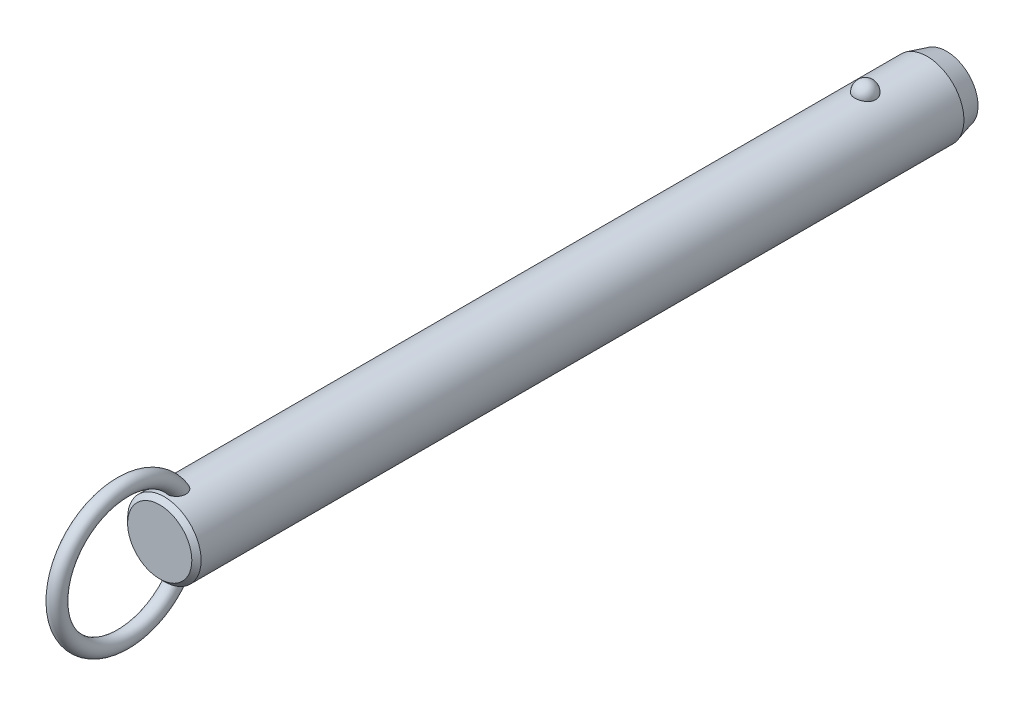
ISO-10303-21;
HEADER;
FILE_DESCRIPTION(('STEP AP214'),'2;1');
FILE_NAME('part.step','',(''),(''),'','','');
FILE_SCHEMA(('AUTOMOTIVE_DESIGN { 1 0 10303 214 1 1 1 1 }'));
ENDSEC;
DATA;
#1=APPLICATION_CONTEXT('core data for automotive mechanical design processes');
#2=APPLICATION_PROTOCOL_DEFINITION('international standard','automotive_design',2000,#1);
#3=PRODUCT_CONTEXT('',#1,'mechanical');
#4=PRODUCT('Part','Part','',(#3));
#5=PRODUCT_RELATED_PRODUCT_CATEGORY('part','',(#4));
#6=PRODUCT_DEFINITION_FORMATION('','',#4);
#7=PRODUCT_DEFINITION_CONTEXT('part definition',#1,'design');
#8=PRODUCT_DEFINITION('design','',#6,#7);
#9=PRODUCT_DEFINITION_SHAPE('','',#8);
#10=(LENGTH_UNIT() NAMED_UNIT(*) SI_UNIT(.MILLI.,.METRE.));
#11=(NAMED_UNIT(*) PLANE_ANGLE_UNIT() SI_UNIT($,.RADIAN.));
#12=(NAMED_UNIT(*) SI_UNIT($,.STERADIAN.) SOLID_ANGLE_UNIT());
#13=UNCERTAINTY_MEASURE_WITH_UNIT(LENGTH_MEASURE(1.E-05),#10,'distance_accuracy_value','');
#14=(GEOMETRIC_REPRESENTATION_CONTEXT(3) GLOBAL_UNCERTAINTY_ASSIGNED_CONTEXT((#13)) GLOBAL_UNIT_ASSIGNED_CONTEXT((#10,
#11,#12)) REPRESENTATION_CONTEXT('',''));
#15=CARTESIAN_POINT('',(0.,0.,0.));
#16=DIRECTION('',(0.,0.,1.));
#17=DIRECTION('',(1.,0.,0.));
#18=AXIS2_PLACEMENT_3D('',#15,#16,#17);
#19=CARTESIAN_POINT('',(0.,0.,170.2));
#20=DIRECTION('',(0.,0.,-1.));
#21=DIRECTION('',(-1.,0.,0.));
#22=AXIS2_PLACEMENT_3D('',#19,#20,#21);
#23=CYLINDRICAL_SURFACE('',#22,9.5);
#24=CARTESIAN_POINT('',(2.67259918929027,9.11631578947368,-2.70000000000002));
#25=CARTESIAN_POINT('',(2.6725968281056,9.11631786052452,-2.54909854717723));
#26=CARTESIAN_POINT('',(2.66030567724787,9.11994722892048,-2.39816735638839));
#27=CARTESIAN_POINT('',(2.6114347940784,9.13405924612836,-2.10058568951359));
#28=CARTESIAN_POINT('',(2.57484658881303,9.14454428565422,-1.95393672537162));
#29=CARTESIAN_POINT('',(2.47830875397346,9.17117631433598,-1.66916069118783));
#30=CARTESIAN_POINT('',(2.41836936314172,9.18732082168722,-1.53102991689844));
#31=CARTESIAN_POINT('',(2.27661331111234,9.22346780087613,-1.26705393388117));
#32=CARTESIAN_POINT('',(2.19479699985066,9.24347021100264,-1.14120852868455));
#33=CARTESIAN_POINT('',(2.01085282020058,9.28522401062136,-0.904632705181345));
#34=CARTESIAN_POINT('',(1.90862396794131,9.30698376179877,-0.793982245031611));
#35=CARTESIAN_POINT('',(1.6867437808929,9.34973971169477,-0.59160721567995));
#36=CARTESIAN_POINT('',(1.56709244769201,9.37073591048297,-0.499882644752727));
#37=CARTESIAN_POINT('',(1.31393976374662,9.40956370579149,-0.338167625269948));
#38=CARTESIAN_POINT('',(1.18048026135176,9.42740444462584,-0.268113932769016));
#39=CARTESIAN_POINT('',(0.903154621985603,9.45799906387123,-0.151390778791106));
#40=CARTESIAN_POINT('',(0.759289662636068,9.47075351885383,-0.104718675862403));
#41=CARTESIAN_POINT('',(0.468074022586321,9.48956256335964,-0.0367633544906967));
#42=CARTESIAN_POINT('',(0.320836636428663,9.49573643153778,-0.0150275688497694));
#43=CARTESIAN_POINT('',(0.0246714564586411,9.50112183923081,0.00396199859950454));
#44=CARTESIAN_POINT('',(-0.124256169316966,9.50033406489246,0.00121819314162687));
#45=CARTESIAN_POINT('',(-0.417264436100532,9.4919475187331,-0.0284441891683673));
#46=CARTESIAN_POINT('',(-0.56138413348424,9.48444885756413,-0.0550074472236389));
#47=CARTESIAN_POINT('',(-0.842986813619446,9.46357853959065,-0.131064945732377));
#48=CARTESIAN_POINT('',(-0.980469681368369,9.450206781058,-0.180559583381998));
#49=CARTESIAN_POINT('',(-1.24585005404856,9.41890822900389,-0.301476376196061));
#50=CARTESIAN_POINT('',(-1.37368611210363,9.40095498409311,-0.373026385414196));
#51=CARTESIAN_POINT('',(-1.61552738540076,9.36242964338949,-0.536025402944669));
#52=CARTESIAN_POINT('',(-1.72953116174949,9.34185727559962,-0.627476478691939));
#53=CARTESIAN_POINT('',(-1.9429225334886,9.29984568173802,-0.829844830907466));
#54=CARTESIAN_POINT('',(-2.04198021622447,9.27839736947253,-0.941108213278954));
#55=CARTESIAN_POINT('',(-2.22026460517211,9.23735994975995,-1.17883414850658));
#56=CARTESIAN_POINT('',(-2.29948985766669,9.21777097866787,-1.30529781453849));
#57=CARTESIAN_POINT('',(-2.43697287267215,9.18238994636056,-1.57158566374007));
#58=CARTESIAN_POINT('',(-2.49497068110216,9.16664569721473,-1.71155057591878));
#59=CARTESIAN_POINT('',(-2.5872073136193,9.14104303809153,-1.99961197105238));
#60=CARTESIAN_POINT('',(-2.62144683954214,9.13118445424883,-2.1477082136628));
#61=CARTESIAN_POINT('',(-2.66521466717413,9.11850622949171,-2.44715424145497));
#62=CARTESIAN_POINT('',(-2.67484831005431,9.11565658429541,-2.59848735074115));
#63=CARTESIAN_POINT('',(-2.66946735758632,9.11723375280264,-2.90067317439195));
#64=CARTESIAN_POINT('',(-2.65445345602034,9.12166036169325,-3.05152590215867));
#65=CARTESIAN_POINT('',(-2.60029711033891,9.13724422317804,-3.34766110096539));
#66=CARTESIAN_POINT('',(-2.56127978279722,9.14836656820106,-3.49296833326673));
#67=CARTESIAN_POINT('',(-2.46018844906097,9.17606676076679,-3.77477535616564));
#68=CARTESIAN_POINT('',(-2.39811349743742,9.1926448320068,-3.91127478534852));
#69=CARTESIAN_POINT('',(-2.25202303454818,9.22952198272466,-4.17244273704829));
#70=CARTESIAN_POINT('',(-2.16788714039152,9.24984129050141,-4.29704106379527));
#71=CARTESIAN_POINT('',(-1.9799408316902,9.29188255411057,-4.53013066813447));
#72=CARTESIAN_POINT('',(-1.87612963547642,9.31360456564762,-4.63862130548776));
#73=CARTESIAN_POINT('',(-1.65105429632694,9.35612959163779,-4.83690299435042));
#74=CARTESIAN_POINT('',(-1.52972405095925,9.37692871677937,-4.9266199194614));
#75=CARTESIAN_POINT('',(-1.27318250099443,9.41518970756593,-5.08429106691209));
#76=CARTESIAN_POINT('',(-1.13797219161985,9.432651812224,-5.15224684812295));
#77=CARTESIAN_POINT('',(-0.859280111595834,9.46208255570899,-5.26371827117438));
#78=CARTESIAN_POINT('',(-0.715925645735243,9.47411833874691,-5.30753421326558));
#79=CARTESIAN_POINT('',(-0.423550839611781,9.4916822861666,-5.37076321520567));
#80=CARTESIAN_POINT('',(-0.2745312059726,9.49721125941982,-5.39017930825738));
#81=CARTESIAN_POINT('',(0.0218446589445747,9.50110860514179,-5.40390587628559));
#82=CARTESIAN_POINT('',(0.16917707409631,9.49961381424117,-5.39869609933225));
#83=CARTESIAN_POINT('',(0.460808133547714,9.48993906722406,-5.36441955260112));
#84=CARTESIAN_POINT('',(0.605106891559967,9.48175936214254,-5.33535367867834));
#85=CARTESIAN_POINT('',(0.886027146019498,9.4596376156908,-5.25435587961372));
#86=CARTESIAN_POINT('',(1.02267710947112,9.44571881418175,-5.20251612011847));
#87=CARTESIAN_POINT('',(1.28523827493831,9.41358993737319,-5.07741549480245));
#88=CARTESIAN_POINT('',(1.41114877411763,9.39537958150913,-5.00415322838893));
#89=CARTESIAN_POINT('',(1.65085227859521,9.3562644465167,-4.83684599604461));
#90=CARTESIAN_POINT('',(1.76442346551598,9.33532178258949,-4.74249218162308));
#91=CARTESIAN_POINT('',(1.97425672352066,9.29321198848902,-4.53620389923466));
#92=CARTESIAN_POINT('',(2.07051582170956,9.27204482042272,-4.42426641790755));
#93=CARTESIAN_POINT('',(2.24490086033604,9.23139221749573,-4.18363183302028));
#94=CARTESIAN_POINT('',(2.32267019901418,9.21194380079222,-4.05466990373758));
#95=CARTESIAN_POINT('',(2.45584092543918,9.1773419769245,-3.78517836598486));
#96=CARTESIAN_POINT('',(2.5112497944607,9.16218713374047,-3.644652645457));
#97=CARTESIAN_POINT('',(2.59380876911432,9.13913522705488,-3.37104301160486));
#98=CARTESIAN_POINT('',(2.62330266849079,9.13064624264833,-3.23871053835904));
#99=CARTESIAN_POINT('',(2.66269870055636,9.11923566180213,-2.97092664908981));
#100=CARTESIAN_POINT('',(2.67260130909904,9.11631393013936,-2.83547530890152));
#101=CARTESIAN_POINT('',(2.67259918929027,9.11631578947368,-2.70000000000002));
#102=B_SPLINE_CURVE_WITH_KNOTS('',3,(#24,#25,#26,#27,#28,#29,#30,#31,#32,#33,#34,#35,#36,#37,
#38,#39,#40,#41,#42,#43,#44,#45,#46,#47,#48,#49,#50,#51,#52,#53,#54,#55,#56,#57,#58,#59,#60,#61,
#62,#63,#64,#65,#66,#67,#68,#69,#70,#71,#72,#73,#74,#75,#76,#77,#78,#79,#80,#81,#82,#83,#84,#85,
#86,#87,#88,#89,#90,#91,#92,#93,#94,#95,#96,#97,#98,#99,#100,#101),.UNSPECIFIED.,.T.,.F.,(4,2,2,
2,2,2,2,2,2,2,2,2,2,2,2,2,2,2,2,2,2,2,2,2,2,2,2,2,2,2,2,2,2,2,2,2,2,2,4),(0.,0.452217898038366,
0.904593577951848,1.35677112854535,1.80894144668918,2.26340676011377,2.71787203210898,
3.17099820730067,3.62407318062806,4.0687883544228,4.51345969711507,4.95160616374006,
5.38976021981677,5.83050358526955,6.27129275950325,6.72071308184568,7.17016633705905,
7.62495278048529,8.07972578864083,8.53254856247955,8.98535859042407,9.43582813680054,
9.88631615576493,10.3393155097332,10.7923328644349,11.2471065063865,11.7018475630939,
12.150795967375,12.599688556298,13.0398725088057,13.4800399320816,13.9184421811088,
14.3568730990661,14.802202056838,15.2476074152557,15.7010097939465,16.1542603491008,
16.5602594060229,16.966248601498),.UNSPECIFIED.);
#103=CARTESIAN_POINT('',(2.67259918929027,9.11631578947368,-2.70000000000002));
#104=VERTEX_POINT('',#103);
#105=EDGE_CURVE('E41',#104,#104,#102,.T.);
#106=ORIENTED_EDGE('',*,*,#105,.T.);
#107=EDGE_LOOP('',(#106));
#108=FACE_BOUND('',#107,.T.);
#109=CARTESIAN_POINT('',(0.,0.,178.52));
#110=DIRECTION('',(0.,0.,1.));
#111=DIRECTION('',(1.,0.,0.));
#112=AXIS2_PLACEMENT_3D('',#109,#110,#111);
#113=CIRCLE('',#112,9.5);
#114=CARTESIAN_POINT('',(9.5,0.,178.52));
#115=VERTEX_POINT('',#114);
#116=EDGE_CURVE('E10',#115,#115,#113,.F.);
#117=ORIENTED_EDGE('',*,*,#116,.T.);
#118=EDGE_LOOP('',(#117));
#119=FACE_BOUND('',#118,.T.);
#120=CARTESIAN_POINT('',(-0.697062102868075,-9.47439269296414,172.867808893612));
#121=CARTESIAN_POINT('',(-0.799579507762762,-9.46685146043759,172.907482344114));
#122=CARTESIAN_POINT('',(-0.89857563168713,-9.45788043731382,172.9559309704));
#123=CARTESIAN_POINT('',(-1.08670047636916,-9.43811593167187,173.068868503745));
#124=CARTESIAN_POINT('',(-1.17583204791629,-9.42732297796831,173.133352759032));
#125=CARTESIAN_POINT('',(-1.34179806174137,-9.40513672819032,173.276209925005));
#126=CARTESIAN_POINT('',(-1.41865133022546,-9.39374438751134,173.354561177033));
#127=CARTESIAN_POINT('',(-1.5586004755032,-9.37154196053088,173.522752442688));
#128=CARTESIAN_POINT('',(-1.62169476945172,-9.3607319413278,173.61259377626));
#129=CARTESIAN_POINT('',(-1.73527695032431,-9.34035749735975,173.804500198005));
#130=CARTESIAN_POINT('',(-1.78522266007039,-9.33085270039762,173.906891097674));
#131=CARTESIAN_POINT('',(-1.86924997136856,-9.3143834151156,174.118148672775));
#132=CARTESIAN_POINT('',(-1.90332570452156,-9.30741986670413,174.227017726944));
#133=CARTESIAN_POINT('',(-1.95893603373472,-9.29588482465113,174.460473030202));
#134=CARTESIAN_POINT('',(-1.97872420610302,-9.29165182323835,174.585489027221));
#135=CARTESIAN_POINT('',(-2.00062129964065,-9.28695978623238,174.837080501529));
#136=CARTESIAN_POINT('',(-2.00272284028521,-9.28650232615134,174.963656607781));
#137=CARTESIAN_POINT('',(-1.98958876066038,-9.28932750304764,175.236815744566));
#138=CARTESIAN_POINT('',(-1.97143366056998,-9.2932400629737,175.383251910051));
#139=CARTESIAN_POINT('',(-1.91479925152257,-9.30507151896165,175.672062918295));
#140=CARTESIAN_POINT('',(-1.87629122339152,-9.31299607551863,175.814431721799));
#141=CARTESIAN_POINT('',(-1.77225683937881,-9.33340232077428,176.115172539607));
#142=CARTESIAN_POINT('',(-1.70334898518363,-9.34641636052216,176.272369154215));
#143=CARTESIAN_POINT('',(-1.58111062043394,-9.36759153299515,176.497517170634));
#144=CARTESIAN_POINT('',(-1.53721459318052,-9.37492619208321,176.570796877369));
#145=CARTESIAN_POINT('',(-1.4430263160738,-9.38988566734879,176.71307405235));
#146=CARTESIAN_POINT('',(-1.39273721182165,-9.39751033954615,176.782073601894));
#147=CARTESIAN_POINT('',(-1.26775962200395,-9.41530678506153,176.936983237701));
#148=CARTESIAN_POINT('',(-1.19052326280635,-9.42548108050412,177.020871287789));
#149=CARTESIAN_POINT('',(-1.02420241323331,-9.44499825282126,177.176008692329));
#150=CARTESIAN_POINT('',(-0.935139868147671,-9.45434261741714,177.247280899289));
#151=CARTESIAN_POINT('',(-0.766610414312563,-9.46930670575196,177.358695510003));
#152=CARTESIAN_POINT('',(-0.689439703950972,-9.47529223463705,177.402235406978));
#153=CARTESIAN_POINT('',(-0.528942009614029,-9.48560294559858,177.47631336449));
#154=CARTESIAN_POINT('',(-0.445620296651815,-9.48992953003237,177.506862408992));
#155=CARTESIAN_POINT('',(-0.273901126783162,-9.49644161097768,177.552579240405));
#156=CARTESIAN_POINT('',(-0.18546574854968,-9.49860811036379,177.56761059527));
#157=CARTESIAN_POINT('',(-0.00734541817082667,-9.5004135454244,177.580149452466));
#158=CARTESIAN_POINT('',(0.0823387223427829,-9.50005405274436,177.577667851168));
#159=CARTESIAN_POINT('',(0.247679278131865,-9.49708301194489,177.556995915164));
#160=CARTESIAN_POINT('',(0.323620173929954,-9.49477609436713,177.540930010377));
#161=CARTESIAN_POINT('',(0.471981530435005,-9.48855917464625,177.497172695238));
#162=CARTESIAN_POINT('',(0.544400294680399,-9.48464840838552,177.469475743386));
#163=CARTESIAN_POINT('',(0.708947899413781,-9.47398336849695,177.39280266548));
#164=CARTESIAN_POINT('',(0.799149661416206,-9.46671310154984,177.339774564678));
#165=CARTESIAN_POINT('',(0.969783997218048,-9.45076225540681,177.219973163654));
#166=CARTESIAN_POINT('',(1.05019415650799,-9.44207854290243,177.153169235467));
#167=CARTESIAN_POINT('',(1.23092343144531,-9.42051459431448,176.980759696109));
#168=CARTESIAN_POINT('',(1.32652499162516,-9.40733378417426,176.87026193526));
#169=CARTESIAN_POINT('',(1.49893121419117,-9.38140745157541,176.635561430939));
#170=CARTESIAN_POINT('',(1.57571616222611,-9.36866239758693,176.511344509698));
#171=CARTESIAN_POINT('',(1.71285426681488,-9.34457644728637,176.249389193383));
#172=CARTESIAN_POINT('',(1.77266365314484,-9.33328726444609,176.11136233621));
#173=CARTESIAN_POINT('',(1.87239208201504,-9.31379209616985,175.828051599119));
#174=CARTESIAN_POINT('',(1.91230158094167,-9.30558759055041,175.682764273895));
#175=CARTESIAN_POINT('',(1.97604189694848,-9.29228394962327,175.362028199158));
#176=CARTESIAN_POINT('',(1.9958743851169,-9.28797202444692,175.185724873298));
#177=CARTESIAN_POINT('',(2.00295708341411,-9.28645519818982,174.832414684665));
#178=CARTESIAN_POINT('',(1.99025930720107,-9.28923895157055,174.655409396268));
#179=CARTESIAN_POINT('',(1.93735479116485,-9.30038134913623,174.356338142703));
#180=CARTESIAN_POINT('',(1.90576827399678,-9.30697680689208,174.232667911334));
#181=CARTESIAN_POINT('',(1.82287484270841,-9.32356855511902,173.992329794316));
#182=CARTESIAN_POINT('',(1.77158213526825,-9.33356239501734,173.875656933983));
#183=CARTESIAN_POINT('',(1.64885744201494,-9.35602275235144,173.652706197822));
#184=CARTESIAN_POINT('',(1.57730995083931,-9.36850332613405,173.546492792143));
#185=CARTESIAN_POINT('',(1.41543264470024,-9.39431873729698,173.349553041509));
#186=CARTESIAN_POINT('',(1.32510883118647,-9.40765330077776,173.258821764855));
#187=CARTESIAN_POINT('',(1.13846223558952,-9.43195720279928,173.105033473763));
#188=CARTESIAN_POINT('',(1.04369890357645,-9.44302894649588,173.040094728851));
#189=CARTESIAN_POINT('',(0.843965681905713,-9.46296805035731,172.928038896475));
#190=CARTESIAN_POINT('',(0.739000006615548,-9.47183631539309,172.880914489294));
#191=CARTESIAN_POINT('',(0.528175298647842,-9.48586140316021,172.808117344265));
#192=CARTESIAN_POINT('',(0.422686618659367,-9.49119633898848,172.78140249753));
#193=CARTESIAN_POINT('',(0.208590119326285,-9.49831365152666,172.746013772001));
#194=CARTESIAN_POINT('',(0.0999817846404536,-9.500095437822,172.737342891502));
#195=CARTESIAN_POINT('',(-0.126104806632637,-9.49988861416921,172.738350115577));
#196=CARTESIAN_POINT('',(-0.24357872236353,-9.49757821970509,172.749594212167));
#197=CARTESIAN_POINT('',(-0.474390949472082,-9.48885165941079,172.793167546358));
#198=CARTESIAN_POINT('',(-0.587729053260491,-9.48243528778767,172.825497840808));
#199=CARTESIAN_POINT('',(-0.697062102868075,-9.47439269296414,172.867808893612));
#200=B_SPLINE_CURVE_WITH_KNOTS('',3,(#120,#121,#122,#123,#124,#125,#126,#127,#128,#129,#130,
#131,#132,#133,#134,#135,#136,#137,#138,#139,#140,#141,#142,#143,#144,#145,#146,#147,#148,#149,
#150,#151,#152,#153,#154,#155,#156,#157,#158,#159,#160,#161,#162,#163,#164,#165,#166,#167,#168,
#169,#170,#171,#172,#173,#174,#175,#176,#177,#178,#179,#180,#181,#182,#183,#184,#185,#186,#187,
#188,#189,#190,#191,#192,#193,#194,#195,#196,#197,#198,#199),.UNSPECIFIED.,.T.,.F.,(4,2,2,2,2,2,
2,2,2,2,2,2,2,2,2,2,2,2,2,2,2,2,2,2,2,2,2,2,2,2,2,2,2,2,2,2,2,2,2,4),(0.,0.330119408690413,
0.6601431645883,0.98965593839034,1.31920659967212,1.66074728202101,2.00241415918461,
2.38088696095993,2.75951768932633,3.20065679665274,3.64242004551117,4.15620996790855,
4.4131416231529,4.66994734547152,5.01228664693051,5.35399933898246,5.61943037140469,
5.88463652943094,6.15215502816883,6.41950709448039,6.65144391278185,6.88349136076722,
7.19641200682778,7.51003602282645,7.94779711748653,8.3860149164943,8.83699707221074,
9.28819530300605,9.81778662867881,10.34653170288,10.7284172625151,11.1100280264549,
11.4938603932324,11.8775702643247,12.2220189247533,12.5663259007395,12.8915939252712,
13.2169159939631,13.5689650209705,13.9210316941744),.UNSPECIFIED.);
#201=CARTESIAN_POINT('',(-0.697062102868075,-9.47439269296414,172.867808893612));
#202=VERTEX_POINT('',#201);
#203=EDGE_CURVE('E60',#202,#202,#200,.T.);
#204=ORIENTED_EDGE('',*,*,#203,.T.);
#205=EDGE_LOOP('',(#204));
#206=FACE_BOUND('',#205,.T.);
#207=CARTESIAN_POINT('',(-0.697062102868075,9.47439269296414,172.867808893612));
#208=CARTESIAN_POINT('',(-0.597792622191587,9.48169483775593,172.829395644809));
#209=CARTESIAN_POINT('',(-0.495106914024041,9.48766580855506,172.799168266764));
#210=CARTESIAN_POINT('',(-0.285876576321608,9.49627648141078,172.756032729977));
#211=CARTESIAN_POINT('',(-0.179324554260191,9.49890941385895,172.743159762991));
#212=CARTESIAN_POINT('',(0.0344157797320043,9.50053798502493,172.735166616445));
#213=CARTESIAN_POINT('',(0.14160360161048,9.49953613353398,172.740034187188));
#214=CARTESIAN_POINT('',(0.353563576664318,9.49401038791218,172.767365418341));
#215=CARTESIAN_POINT('',(0.458336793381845,9.48948807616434,172.78982117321));
#216=CARTESIAN_POINT('',(0.662493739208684,9.4774236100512,172.851671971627));
#217=CARTESIAN_POINT('',(0.761881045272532,9.46988348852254,172.891055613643));
#218=CARTESIAN_POINT('',(0.952608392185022,9.45260382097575,172.985634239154));
#219=CARTESIAN_POINT('',(1.04394806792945,9.44286417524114,173.040829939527));
#220=CARTESIAN_POINT('',(1.21712767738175,9.42211760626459,173.166066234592));
#221=CARTESIAN_POINT('',(1.29885671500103,9.41109835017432,173.236257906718));
#222=CARTESIAN_POINT('',(1.4497897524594,9.38903310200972,173.388980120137));
#223=CARTESIAN_POINT('',(1.51899278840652,9.37798710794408,173.471511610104));
#224=CARTESIAN_POINT('',(1.64602857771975,9.35654375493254,173.649776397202));
#225=CARTESIAN_POINT('',(1.70333052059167,9.34618688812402,173.745891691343));
#226=CARTESIAN_POINT('',(1.80259341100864,9.32755128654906,173.945897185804));
#227=CARTESIAN_POINT('',(1.84454942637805,9.31927322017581,174.049789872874));
#228=CARTESIAN_POINT('',(1.91637039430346,9.30478365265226,174.272213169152));
#229=CARTESIAN_POINT('',(1.944805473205,9.29882552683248,174.391219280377));
#230=CARTESIAN_POINT('',(1.98449865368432,9.29043398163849,174.632143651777));
#231=CARTESIAN_POINT('',(1.99574908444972,9.28800213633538,174.754063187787));
#232=CARTESIAN_POINT('',(2.00275141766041,9.28649645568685,175.016932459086));
#233=CARTESIAN_POINT('',(1.99588238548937,9.28799035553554,175.157952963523));
#234=CARTESIAN_POINT('',(1.96270559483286,9.29505517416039,175.437621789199));
#235=CARTESIAN_POINT('',(1.93637872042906,9.30063010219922,175.576267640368));
#236=CARTESIAN_POINT('',(1.85949176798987,9.31633564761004,175.872561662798));
#237=CARTESIAN_POINT('',(1.80549792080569,9.3270926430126,176.029290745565));
#238=CARTESIAN_POINT('',(1.67376869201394,9.3516306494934,176.332284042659));
#239=CARTESIAN_POINT('',(1.59603181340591,9.36541185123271,176.478547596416));
#240=CARTESIAN_POINT('',(1.4360277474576,9.39110706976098,176.725813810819));
#241=CARTESIAN_POINT('',(1.35831795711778,9.40278656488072,176.829791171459));
#242=CARTESIAN_POINT('',(1.18774483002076,9.42585025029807,177.024534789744));
#243=CARTESIAN_POINT('',(1.09490932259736,9.43723493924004,177.115324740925));
#244=CARTESIAN_POINT('',(0.921110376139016,9.45552616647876,177.25620334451));
#245=CARTESIAN_POINT('',(0.843738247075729,9.46281058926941,177.310656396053));
#246=CARTESIAN_POINT('',(0.681245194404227,9.47589120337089,177.406711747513));
#247=CARTESIAN_POINT('',(0.596135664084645,9.48168953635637,177.448332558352));
#248=CARTESIAN_POINT('',(0.433779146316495,9.49038144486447,177.510089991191));
#249=CARTESIAN_POINT('',(0.35745955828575,9.49359170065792,177.53260136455));
#250=CARTESIAN_POINT('',(0.202074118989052,9.49816761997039,177.564574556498));
#251=CARTESIAN_POINT('',(0.123010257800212,9.49953459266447,177.574045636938));
#252=CARTESIAN_POINT('',(-0.0357372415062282,9.50026497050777,177.579114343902));
#253=CARTESIAN_POINT('',(-0.115421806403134,9.49962433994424,177.574684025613));
#254=CARTESIAN_POINT('',(-0.272823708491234,9.49640854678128,177.552296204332));
#255=CARTESIAN_POINT('',(-0.350540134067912,9.4938325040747,177.534332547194));
#256=CARTESIAN_POINT('',(-0.500580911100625,9.48709462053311,177.486802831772));
#257=CARTESIAN_POINT('',(-0.572979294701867,9.48296359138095,177.457461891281));
#258=CARTESIAN_POINT('',(-0.71286452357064,9.47347609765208,177.389008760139));
#259=CARTESIAN_POINT('',(-0.780349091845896,9.46811906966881,177.349892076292));
#260=CARTESIAN_POINT('',(-0.946309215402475,9.45329720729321,177.239432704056));
#261=CARTESIAN_POINT('',(-1.04090230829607,9.44321512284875,177.162329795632));
#262=CARTESIAN_POINT('',(-1.21661929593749,9.42219227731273,176.99409718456));
#263=CARTESIAN_POINT('',(-1.29770519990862,9.41124921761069,176.902929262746));
#264=CARTESIAN_POINT('',(-1.47319646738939,9.38563439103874,176.676162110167));
#265=CARTESIAN_POINT('',(-1.5620887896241,9.37102009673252,176.536289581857));
#266=CARTESIAN_POINT('',(-1.71623987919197,9.34401559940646,176.243950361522));
#267=CARTESIAN_POINT('',(-1.7814786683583,9.33162728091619,176.091473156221));
#268=CARTESIAN_POINT('',(-1.88853837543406,9.31055541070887,175.775647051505));
#269=CARTESIAN_POINT('',(-1.92998995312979,9.30193076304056,175.612168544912));
#270=CARTESIAN_POINT('',(-1.98590726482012,9.29015757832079,175.280526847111));
#271=CARTESIAN_POINT('',(-2.0004070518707,9.2870021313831,175.112369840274));
#272=CARTESIAN_POINT('',(-1.99964701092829,9.28716218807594,174.805080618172));
#273=CARTESIAN_POINT('',(-1.98908145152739,9.28945704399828,174.665936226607));
#274=CARTESIAN_POINT('',(-1.94566294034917,9.29865169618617,174.391153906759));
#275=CARTESIAN_POINT('',(-1.91282062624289,9.30554929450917,174.255514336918));
#276=CARTESIAN_POINT('',(-1.84582133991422,9.31898248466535,174.057802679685));
#277=CARTESIAN_POINT('',(-1.82038084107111,9.32400364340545,173.992583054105));
#278=CARTESIAN_POINT('',(-1.7635051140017,9.33492884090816,173.864903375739));
#279=CARTESIAN_POINT('',(-1.73207305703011,9.34083241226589,173.802441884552));
#280=CARTESIAN_POINT('',(-1.66324243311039,9.35333332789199,173.68094078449));
#281=CARTESIAN_POINT('',(-1.625842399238,9.35993084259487,173.621902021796));
#282=CARTESIAN_POINT('',(-1.54527678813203,9.37356864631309,173.507987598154));
#283=CARTESIAN_POINT('',(-1.50211241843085,9.38060884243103,173.453111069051));
#284=CARTESIAN_POINT('',(-1.37681147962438,9.40004442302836,173.309961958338));
#285=CARTESIAN_POINT('',(-1.28916358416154,9.41261047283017,173.226429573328));
#286=CARTESIAN_POINT('',(-1.09996826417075,9.43658180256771,173.077236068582));
#287=CARTESIAN_POINT('',(-0.998461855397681,9.44799034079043,173.011523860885));
#288=CARTESIAN_POINT('',(-0.860188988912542,9.46103017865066,172.9394367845));
#289=CARTESIAN_POINT('',(-0.828141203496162,9.46389141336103,172.923851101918));
#290=CARTESIAN_POINT('',(-0.763210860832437,9.46934915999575,172.894473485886));
#291=CARTESIAN_POINT('',(-0.730328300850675,9.47194567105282,172.880681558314));
#292=CARTESIAN_POINT('',(-0.697062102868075,9.47439269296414,172.867808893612));
#293=B_SPLINE_CURVE_WITH_KNOTS('',3,(#207,#208,#209,#210,#211,#212,#213,#214,#215,#216,#217,
#218,#219,#220,#221,#222,#223,#224,#225,#226,#227,#228,#229,#230,#231,#232,#233,#234,#235,#236,
#237,#238,#239,#240,#241,#242,#243,#244,#245,#246,#247,#248,#249,#250,#251,#252,#253,#254,#255,
#256,#257,#258,#259,#260,#261,#262,#263,#264,#265,#266,#267,#268,#269,#270,#271,#272,#273,#274,
#275,#276,#277,#278,#279,#280,#281,#282,#283,#284,#285,#286,#287,#288,#289,#290,#291,#292),
.UNSPECIFIED.,.T.,.F.,(4,2,2,2,2,2,2,2,2,2,2,2,2,2,2,2,2,2,2,2,2,2,2,2,2,2,2,2,2,2,2,2,2,2,2,2,
2,2,2,2,2,2,4),(0.,0.319942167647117,0.640532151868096,0.960900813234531,1.28112555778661,
1.60113495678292,1.92115886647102,2.24457323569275,2.56801248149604,2.90371927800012,
3.23953387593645,3.60560313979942,3.97183576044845,4.39383693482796,4.8162532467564,
5.31257045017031,5.80891895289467,6.19868344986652,6.58773876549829,6.87145417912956,
7.15475838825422,7.39263751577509,7.63034760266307,7.86853584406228,8.10683246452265,
8.3406366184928,8.57454843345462,8.93983939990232,9.30614105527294,9.8026666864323,
10.2996107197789,10.8040753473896,11.3079021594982,11.7249776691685,12.1418541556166,
12.3521485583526,12.5623319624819,12.7725671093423,12.9827582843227,13.345827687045,
13.7078449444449,13.8150604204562,13.9222762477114),.UNSPECIFIED.);
#294=CARTESIAN_POINT('',(-0.697062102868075,9.47439269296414,172.867808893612));
#295=VERTEX_POINT('',#294);
#296=EDGE_CURVE('E68',#295,#295,#293,.T.);
#297=ORIENTED_EDGE('',*,*,#296,.T.);
#298=EDGE_LOOP('',(#297));
#299=FACE_BOUND('',#298,.T.);
#300=CARTESIAN_POINT('',(0.,0.,-18.6999999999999));
#301=DIRECTION('',(0.,0.,-1.));
#302=DIRECTION('',(-1.,0.,0.));
#303=AXIS2_PLACEMENT_3D('',#300,#301,#302);
#304=CIRCLE('',#303,9.5);
#305=CARTESIAN_POINT('',(-9.5,0.,-18.6999999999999));
#306=VERTEX_POINT('',#305);
#307=EDGE_CURVE('E57',#306,#306,#304,.F.);
#308=ORIENTED_EDGE('',*,*,#307,.T.);
#309=EDGE_LOOP('',(#308));
#310=FACE_BOUND('',#309,.T.);
#311=ADVANCED_FACE('F37',(#108,#119,#206,#299,#310),#23,.T.);
#312=CARTESIAN_POINT('',(0.,0.,-23.7));
#313=DIRECTION('',(0.,0.,-1.));
#314=DIRECTION('',(-1.,0.,0.));
#315=AXIS2_PLACEMENT_3D('',#312,#313,#314);
#316=PLANE('',#315);
#317=CARTESIAN_POINT('',(0.,0.,-23.7));
#318=DIRECTION('',(0.,0.,-1.));
#319=DIRECTION('',(-1.,0.,0.));
#320=AXIS2_PLACEMENT_3D('',#317,#318,#319);
#321=CIRCLE('',#320,8.16025403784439);
#322=CARTESIAN_POINT('',(-8.16025403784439,0.,-23.7));
#323=VERTEX_POINT('',#322);
#324=EDGE_CURVE('E67',#323,#323,#321,.T.);
#325=ORIENTED_EDGE('',*,*,#324,.T.);
#326=EDGE_LOOP('',(#325));
#327=FACE_BOUND('',#326,.T.);
#328=ADVANCED_FACE('F86',(#327),#316,.T.);
#329=CARTESIAN_POINT('',(0.,0.,-23.7));
#330=DIRECTION('',(0.,0.,1.));
#331=DIRECTION('',(1.,0.,0.));
#332=AXIS2_PLACEMENT_3D('',#329,#330,#331);
#333=CONICAL_SURFACE('',#332,8.16025403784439,0.261799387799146);
#334=ORIENTED_EDGE('',*,*,#307,.F.);
#335=EDGE_LOOP('',(#334));
#336=FACE_BOUND('',#335,.T.);
#337=ORIENTED_EDGE('',*,*,#324,.F.);
#338=EDGE_LOOP('',(#337));
#339=FACE_BOUND('',#338,.T.);
#340=ADVANCED_FACE('F84',(#336,#339),#333,.T.);
#341=CARTESIAN_POINT('',(0.,0.,179.72));
#342=DIRECTION('',(0.,0.,1.));
#343=DIRECTION('',(1.,0.,0.));
#344=AXIS2_PLACEMENT_3D('',#341,#342,#343);
#345=PLANE('',#344);
#346=CARTESIAN_POINT('',(0.,0.,179.72));
#347=DIRECTION('',(0.,0.,1.));
#348=DIRECTION('',(1.,0.,0.));
#349=AXIS2_PLACEMENT_3D('',#346,#347,#348);
#350=CIRCLE('',#349,8.30000000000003);
#351=CARTESIAN_POINT('',(8.30000000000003,0.,179.72));
#352=VERTEX_POINT('',#351);
#353=EDGE_CURVE('E50',#352,#352,#350,.T.);
#354=ORIENTED_EDGE('',*,*,#353,.T.);
#355=EDGE_LOOP('',(#354));
#356=FACE_BOUND('',#355,.T.);
#357=ADVANCED_FACE('F78',(#356),#345,.T.);
#358=CARTESIAN_POINT('',(0.,0.,189.25));
#359=DIRECTION('',(1.,0.,0.));
#360=DIRECTION('',(0.,0.,-1.));
#361=AXIS2_PLACEMENT_3D('',#358,#359,#360);
#362=TOROIDAL_SURFACE('',#361,17.05,2.);
#363=ORIENTED_EDGE('',*,*,#296,.F.);
#364=EDGE_LOOP('',(#363));
#365=FACE_BOUND('',#364,.T.);
#366=ORIENTED_EDGE('',*,*,#203,.F.);
#367=EDGE_LOOP('',(#366));
#368=FACE_BOUND('',#367,.T.);
#369=ADVANCED_FACE('F74',(#365,#368),#362,.T.);
#370=CARTESIAN_POINT('',(0.,0.,179.72));
#371=DIRECTION('',(0.,0.,-1.));
#372=DIRECTION('',(-1.,0.,0.));
#373=AXIS2_PLACEMENT_3D('',#370,#371,#372);
#374=CONICAL_SURFACE('',#373,8.30000000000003,0.785398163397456);
#375=ORIENTED_EDGE('',*,*,#116,.F.);
#376=EDGE_LOOP('',(#375));
#377=FACE_BOUND('',#376,.T.);
#378=ORIENTED_EDGE('',*,*,#353,.F.);
#379=EDGE_LOOP('',(#378));
#380=FACE_BOUND('',#379,.T.);
#381=ADVANCED_FACE('F39',(#377,#380),#374,.T.);
#382=CARTESIAN_POINT('',(0.,9.5,-2.70000000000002));
#383=DIRECTION('',(0.,1.,0.));
#384=DIRECTION('',(0.,0.,-1.));
#385=AXIS2_PLACEMENT_3D('',#382,#383,#384);
#386=SPHERICAL_SURFACE('',#385,2.7);
#387=ORIENTED_EDGE('',*,*,#105,.F.);
#388=EDGE_LOOP('',(#387));
#389=FACE_BOUND('',#388,.T.);
#390=ADVANCED_FACE('F80',(#389),#386,.T.);
#391=CLOSED_SHELL('',(#311,#328,#340,#357,#369,#381,#390));
#392=MANIFOLD_SOLID_BREP('B2',#391);
#393=ADVANCED_BREP_SHAPE_REPRESENTATION('',(#18,#392),#14);
#394=SHAPE_DEFINITION_REPRESENTATION(#9,#393);
ENDSEC;
END-ISO-10303-21;
